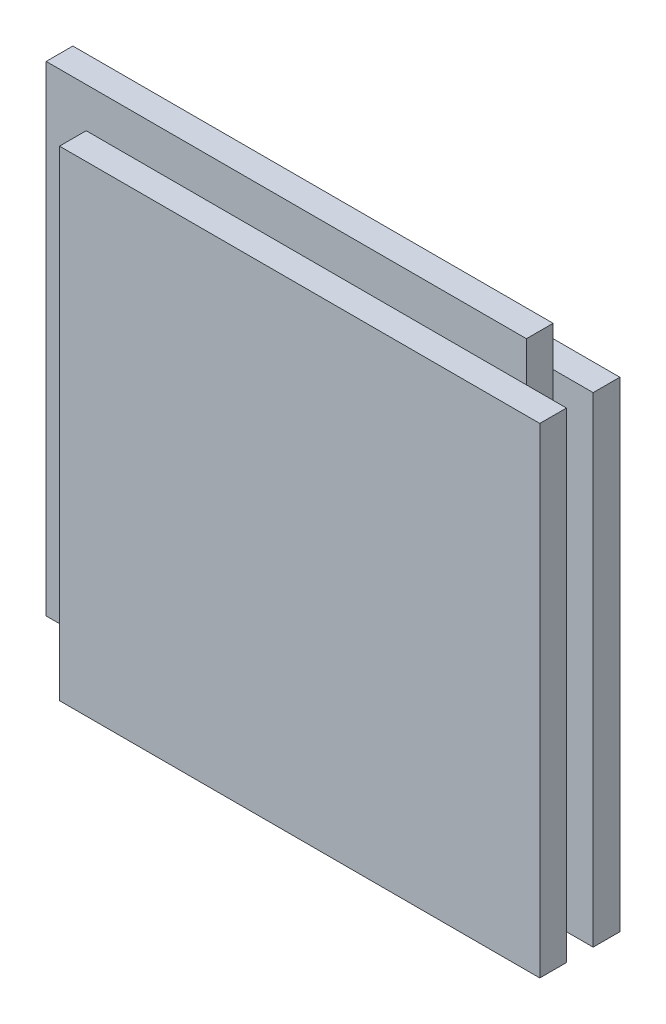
from build123d import *

# Parameters (mm, degrees)
SKETCH1_W           = 180
SKETCH1_H           = 180
BOSS_EXTRUDE1_DEPTH = 5
SKETCH2_W           = 180
SKETCH2_H           = 180
BOSS_EXTRUDE2_DEPTH = 10
SKETCH3_W           = 180
SKETCH3_H           = 180
BOSS_EXTRUDE3_DEPTH = 10


with BuildPart() as part:
    # Sketch1 → Boss-Extrude1 (new, symmetric)
    with BuildSketch(Plane.XY):
        Rectangle(SKETCH1_W, SKETCH1_H)
    extrude(amount=BOSS_EXTRUDE1_DEPTH, both=True)

    # Sketch2 → Boss-Extrude2 (add)
    with BuildSketch(Plane.XY.offset(5)):
        with Locations((15, -15)):
            Rectangle(SKETCH2_W, SKETCH2_H)
    extrude(amount=BOSS_EXTRUDE2_DEPTH)

    # Sketch3 → Boss-Extrude3 (add)
    with BuildSketch(Plane(origin=(0, 0, -5), x_dir=(-1, 0, 0), z_dir=(0, 0, -1))):
        with Locations((-15, -15)):
            Rectangle(SKETCH3_W, SKETCH3_H)
    extrude(amount=BOSS_EXTRUDE3_DEPTH)


solid = part.part
